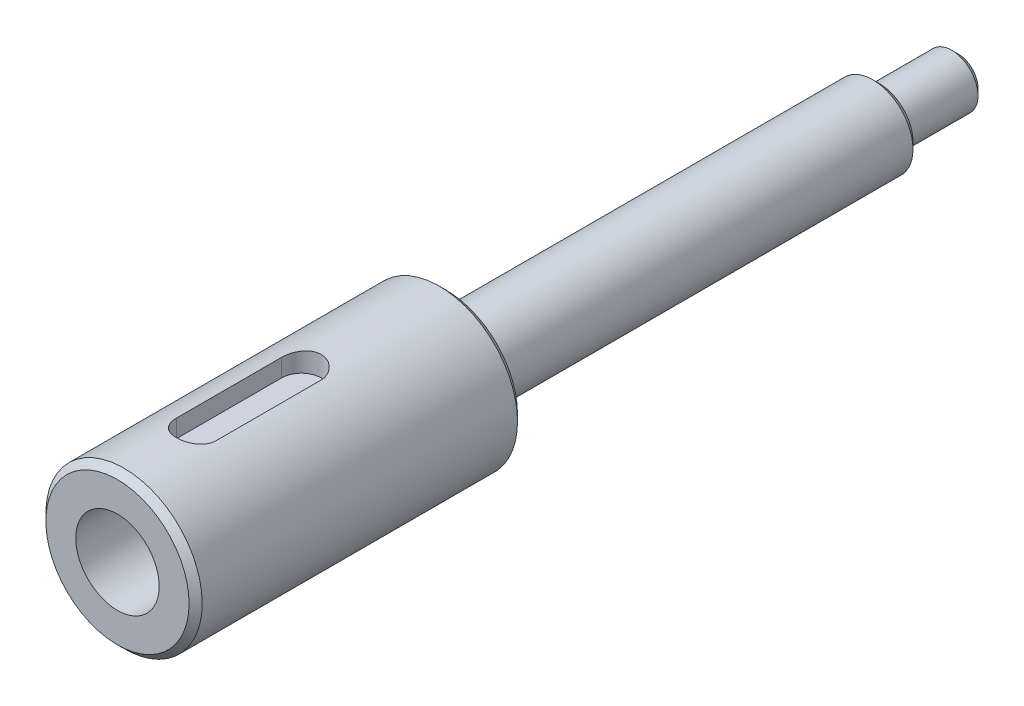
ISO-10303-21;
HEADER;
FILE_DESCRIPTION(('STEP AP214'),'2;1');
FILE_NAME('part.step','',(''),(''),'','','');
FILE_SCHEMA(('AUTOMOTIVE_DESIGN { 1 0 10303 214 1 1 1 1 }'));
ENDSEC;
DATA;
#1=APPLICATION_CONTEXT('core data for automotive mechanical design processes');
#2=APPLICATION_PROTOCOL_DEFINITION('international standard','automotive_design',2000,#1);
#3=PRODUCT_CONTEXT('',#1,'mechanical');
#4=PRODUCT('Part','Part','',(#3));
#5=PRODUCT_RELATED_PRODUCT_CATEGORY('part','',(#4));
#6=PRODUCT_DEFINITION_FORMATION('','',#4);
#7=PRODUCT_DEFINITION_CONTEXT('part definition',#1,'design');
#8=PRODUCT_DEFINITION('design','',#6,#7);
#9=PRODUCT_DEFINITION_SHAPE('','',#8);
#10=(LENGTH_UNIT() NAMED_UNIT(*) SI_UNIT(.MILLI.,.METRE.));
#11=(NAMED_UNIT(*) PLANE_ANGLE_UNIT() SI_UNIT($,.RADIAN.));
#12=(NAMED_UNIT(*) SI_UNIT($,.STERADIAN.) SOLID_ANGLE_UNIT());
#13=UNCERTAINTY_MEASURE_WITH_UNIT(LENGTH_MEASURE(1.E-05),#10,'distance_accuracy_value','');
#14=(GEOMETRIC_REPRESENTATION_CONTEXT(3) GLOBAL_UNCERTAINTY_ASSIGNED_CONTEXT((#13)) GLOBAL_UNIT_ASSIGNED_CONTEXT((#10,
#11,#12)) REPRESENTATION_CONTEXT('',''));
#15=CARTESIAN_POINT('',(0.,0.,0.));
#16=DIRECTION('',(0.,0.,1.));
#17=DIRECTION('',(1.,0.,0.));
#18=AXIS2_PLACEMENT_3D('',#15,#16,#17);
#19=CARTESIAN_POINT('',(0.,0.,-39.));
#20=DIRECTION('',(0.,0.,1.));
#21=DIRECTION('',(1.,0.,0.));
#22=AXIS2_PLACEMENT_3D('',#19,#20,#21);
#23=CYLINDRICAL_SURFACE('',#22,3.05);
#24=CARTESIAN_POINT('',(0.,0.,-32.5));
#25=DIRECTION('',(0.,0.,-1.));
#26=DIRECTION('',(-1.,0.,0.));
#27=AXIS2_PLACEMENT_3D('',#24,#25,#26);
#28=CIRCLE('',#27,3.05);
#29=CARTESIAN_POINT('',(-3.05,0.,-32.5));
#30=VERTEX_POINT('',#29);
#31=EDGE_CURVE('E12',#30,#30,#28,.F.);
#32=ORIENTED_EDGE('',*,*,#31,.T.);
#33=EDGE_LOOP('',(#32));
#34=FACE_BOUND('',#33,.T.);
#35=CARTESIAN_POINT('',(0.,0.,0.));
#36=DIRECTION('',(0.,0.,1.));
#37=DIRECTION('',(1.,0.,0.));
#38=AXIS2_PLACEMENT_3D('',#35,#36,#37);
#39=CIRCLE('',#38,3.05);
#40=CARTESIAN_POINT('',(3.05,0.,0.));
#41=VERTEX_POINT('',#40);
#42=EDGE_CURVE('E122',#41,#41,#39,.F.);
#43=ORIENTED_EDGE('',*,*,#42,.T.);
#44=EDGE_LOOP('',(#43));
#45=FACE_BOUND('',#44,.T.);
#46=ADVANCED_FACE('F39',(#34,#45),#23,.T.);
#47=CARTESIAN_POINT('',(0.,0.,25.));
#48=DIRECTION('',(0.,0.,-1.));
#49=DIRECTION('',(-1.,0.,0.));
#50=AXIS2_PLACEMENT_3D('',#47,#48,#49);
#51=CYLINDRICAL_SURFACE('',#50,5.95);
#52=CARTESIAN_POINT('',(0.,-5.95,3.5));
#53=CARTESIAN_POINT('',(0.0419493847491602,-5.94999941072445,3.49999821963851));
#54=CARTESIAN_POINT('',(0.0839249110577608,-5.94955168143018,3.49646863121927));
#55=CARTESIAN_POINT('',(0.166707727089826,-5.94780866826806,3.48244424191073));
#56=CARTESIAN_POINT('',(0.207513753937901,-5.94651250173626,3.47194218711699));
#57=CARTESIAN_POINT('',(0.286747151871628,-5.94321862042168,3.44428737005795));
#58=CARTESIAN_POINT('',(0.32517611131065,-5.94122138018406,3.42713910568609));
#59=CARTESIAN_POINT('',(0.398603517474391,-5.93674742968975,3.38668852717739));
#60=CARTESIAN_POINT('',(0.433602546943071,-5.93427080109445,3.36338726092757));
#61=CARTESIAN_POINT('',(0.499379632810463,-5.92909905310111,3.3111527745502));
#62=CARTESIAN_POINT('',(0.530135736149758,-5.92640290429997,3.28219200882));
#63=CARTESIAN_POINT('',(0.586364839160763,-5.92110427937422,3.21951975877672));
#64=CARTESIAN_POINT('',(0.611837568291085,-5.91850180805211,3.18580803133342));
#65=CARTESIAN_POINT('',(0.65685875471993,-5.91367506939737,3.11444796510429));
#66=CARTESIAN_POINT('',(0.676386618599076,-5.91145212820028,3.07678653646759));
#67=CARTESIAN_POINT('',(0.708832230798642,-5.90764973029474,2.99868608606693));
#68=CARTESIAN_POINT('',(0.721750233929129,-5.9060702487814,2.9582471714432));
#69=CARTESIAN_POINT('',(0.740542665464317,-5.90374344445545,2.87596762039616));
#70=CARTESIAN_POINT('',(0.746454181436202,-5.90299174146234,2.83413558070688));
#71=CARTESIAN_POINT('',(0.75118059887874,-5.90239220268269,2.75006694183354));
#72=CARTESIAN_POINT('',(0.749995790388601,-5.90254432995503,2.70783035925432));
#73=CARTESIAN_POINT('',(0.740593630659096,-5.90373125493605,2.62441018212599));
#74=CARTESIAN_POINT('',(0.732417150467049,-5.90476092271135,2.58322189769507));
#75=CARTESIAN_POINT('',(0.709327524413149,-5.90757890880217,2.50280673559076));
#76=CARTESIAN_POINT('',(0.694414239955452,-5.90936724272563,2.46357989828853));
#77=CARTESIAN_POINT('',(0.658230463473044,-5.9135068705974,2.38807426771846));
#78=CARTESIAN_POINT('',(0.636942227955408,-5.91585973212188,2.35180406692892));
#79=CARTESIAN_POINT('',(0.588625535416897,-5.92086209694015,2.28333544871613));
#80=CARTESIAN_POINT('',(0.561596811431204,-5.92351161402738,2.25113722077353));
#81=CARTESIAN_POINT('',(0.502339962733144,-5.928831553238,2.19148932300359));
#82=CARTESIAN_POINT('',(0.470076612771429,-5.9315019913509,2.16407463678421));
#83=CARTESIAN_POINT('',(0.401387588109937,-5.93654545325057,2.1150444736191));
#84=CARTESIAN_POINT('',(0.364961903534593,-5.93891847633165,2.09342901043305));
#85=CARTESIAN_POINT('',(0.288955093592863,-5.94310124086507,2.05661078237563));
#86=CARTESIAN_POINT('',(0.249372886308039,-5.94491078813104,2.04141022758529));
#87=CARTESIAN_POINT('',(0.168189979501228,-5.94776095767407,2.01788117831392));
#88=CARTESIAN_POINT('',(0.126589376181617,-5.94880161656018,2.00955235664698));
#89=CARTESIAN_POINT('',(0.0428530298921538,-5.94999199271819,2.00004858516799));
#90=CARTESIAN_POINT('',(0.000722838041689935,-5.95014771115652,1.9988254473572));
#91=CARTESIAN_POINT('',(-0.0831419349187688,-5.94956686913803,2.00344056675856));
#92=CARTESIAN_POINT('',(-0.124876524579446,-5.94883032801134,2.00927867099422));
#93=CARTESIAN_POINT('',(-0.206623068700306,-5.94655146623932,2.02781051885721));
#94=CARTESIAN_POINT('',(-0.246640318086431,-5.94501184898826,2.04048126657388));
#95=CARTESIAN_POINT('',(-0.323981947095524,-5.94129919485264,2.07229480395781));
#96=CARTESIAN_POINT('',(-0.361306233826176,-5.93912613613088,2.09143781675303));
#97=CARTESIAN_POINT('',(-0.432417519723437,-5.93437388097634,2.13576893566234));
#98=CARTESIAN_POINT('',(-0.466184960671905,-5.9317926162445,2.16098818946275));
#99=CARTESIAN_POINT('',(-0.529024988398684,-5.92651911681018,2.21671186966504));
#100=CARTESIAN_POINT('',(-0.558097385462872,-5.92382687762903,2.247216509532));
#101=CARTESIAN_POINT('',(-0.610893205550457,-5.91861632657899,2.31285739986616));
#102=CARTESIAN_POINT('',(-0.63458467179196,-5.91609911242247,2.34801945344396));
#103=CARTESIAN_POINT('',(-0.675725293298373,-5.9115417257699,2.42185193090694));
#104=CARTESIAN_POINT('',(-0.693174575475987,-5.90950154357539,2.46052228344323));
#105=CARTESIAN_POINT('',(-0.721283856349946,-5.90613670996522,2.54017083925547));
#106=CARTESIAN_POINT('',(-0.731961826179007,-5.90481016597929,2.58114261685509));
#107=CARTESIAN_POINT('',(-0.746283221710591,-5.90301738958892,2.66431548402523));
#108=CARTESIAN_POINT('',(-0.749926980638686,-5.90255111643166,2.70651651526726));
#109=CARTESIAN_POINT('',(-0.750070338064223,-5.90253287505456,2.79063200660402));
#110=CARTESIAN_POINT('',(-0.746620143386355,-5.90297448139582,2.83254638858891));
#111=CARTESIAN_POINT('',(-0.732779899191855,-5.90470842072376,2.91519443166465));
#112=CARTESIAN_POINT('',(-0.722389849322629,-5.90600075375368,2.9559280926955));
#113=CARTESIAN_POINT('',(-0.694980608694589,-5.90928853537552,3.03505152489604));
#114=CARTESIAN_POINT('',(-0.677963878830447,-5.91128372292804,3.07344216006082));
#115=CARTESIAN_POINT('',(-0.637789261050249,-5.91575283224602,3.14683117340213));
#116=CARTESIAN_POINT('',(-0.614631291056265,-5.91822676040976,3.18182950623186));
#117=CARTESIAN_POINT('',(-0.562645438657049,-5.92339557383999,3.24769703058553));
#118=CARTESIAN_POINT('',(-0.533780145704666,-5.92609184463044,3.27853658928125));
#119=CARTESIAN_POINT('',(-0.471277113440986,-5.93138933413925,3.33495337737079));
#120=CARTESIAN_POINT('',(-0.437638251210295,-5.93399053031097,3.36052936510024));
#121=CARTESIAN_POINT('',(-0.366393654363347,-5.93881590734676,3.40577736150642));
#122=CARTESIAN_POINT('',(-0.328773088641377,-5.94103859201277,3.42542616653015));
#123=CARTESIAN_POINT('',(-0.250759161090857,-5.9448413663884,3.45809917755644));
#124=CARTESIAN_POINT('',(-0.21036886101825,-5.94642215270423,3.47113056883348));
#125=CARTESIAN_POINT('',(-0.141475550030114,-5.94838273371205,3.48708581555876));
#126=CARTESIAN_POINT('',(-0.113406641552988,-5.94898624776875,3.4919216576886));
#127=CARTESIAN_POINT('',(-0.0568958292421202,-5.94979507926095,3.49837934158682));
#128=CARTESIAN_POINT('',(-0.0284539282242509,-5.95000039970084,3.50000120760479));
#129=CARTESIAN_POINT('',(0.,-5.95,3.5));
#130=B_SPLINE_CURVE_WITH_KNOTS('',3,(#52,#53,#54,#55,#56,#57,#58,#59,#60,#61,#62,#63,#64,#65,
#66,#67,#68,#69,#70,#71,#72,#73,#74,#75,#76,#77,#78,#79,#80,#81,#82,#83,#84,#85,#86,#87,#88,#89,
#90,#91,#92,#93,#94,#95,#96,#97,#98,#99,#100,#101,#102,#103,#104,#105,#106,#107,#108,#109,#110,
#111,#112,#113,#114,#115,#116,#117,#118,#119,#120,#121,#122,#123,#124,#125,#126,#127,#128,#129),
.UNSPECIFIED.,.T.,.F.,(4,2,2,2,2,2,2,2,2,2,2,2,2,2,2,2,2,2,2,2,2,2,2,2,2,2,2,2,2,2,2,2,2,2,2,2,
2,2,4),(0.,0.125744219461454,0.251619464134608,0.377409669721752,0.503178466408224,
0.629575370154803,0.755978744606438,0.882815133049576,1.00964663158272,1.13580372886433,
1.26195566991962,1.38737516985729,1.51279725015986,1.63857171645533,1.76435203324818,
1.89101682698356,2.01768192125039,2.14439061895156,2.27109328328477,2.39693568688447,
2.52277536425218,2.64819413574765,2.77361723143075,2.89969748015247,3.02578282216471,
3.15259845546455,3.27941151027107,3.40588657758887,3.53235565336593,3.65793273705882,
3.78350982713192,3.90904032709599,4.03457250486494,4.16095656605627,4.28737040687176,
4.41427289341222,4.54103729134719,4.62632922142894,4.71162050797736),.UNSPECIFIED.);
#131=CARTESIAN_POINT('',(0.,-5.95,3.5));
#132=VERTEX_POINT('',#131);
#133=EDGE_CURVE('E104',#132,#132,#130,.T.);
#134=ORIENTED_EDGE('',*,*,#133,.T.);
#135=EDGE_LOOP('',(#134));
#136=FACE_BOUND('',#135,.T.);
#137=DIRECTION('',(0.,0.,-1.));
#138=VECTOR('',#137,1.);
#139=CARTESIAN_POINT('',(1.5,5.75782076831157,25.));
#140=LINE('',#139,#138);
#141=CARTESIAN_POINT('',(1.5,5.75782076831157,11.));
#142=VERTEX_POINT('',#141);
#143=CARTESIAN_POINT('',(1.5,5.75782076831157,19.));
#144=VERTEX_POINT('',#143);
#145=EDGE_CURVE('E144',#142,#144,#140,.F.);
#146=ORIENTED_EDGE('',*,*,#145,.T.);
#147=CARTESIAN_POINT('',(1.5,5.75782076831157,19.));
#148=CARTESIAN_POINT('',(1.50000051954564,5.75781794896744,19.0414824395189));
#149=CARTESIAN_POINT('',(1.49827811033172,5.75826963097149,19.0829443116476));
#150=CARTESIAN_POINT('',(1.49141196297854,5.76005287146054,19.1655577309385));
#151=CARTESIAN_POINT('',(1.48626880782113,5.76138428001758,19.2067093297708));
#152=CARTESIAN_POINT('',(1.46578353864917,5.76664453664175,19.3290808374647));
#153=CARTESIAN_POINT('',(1.44538528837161,5.77183974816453,19.4094594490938));
#154=CARTESIAN_POINT('',(1.39176749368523,5.78500082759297,19.5655093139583));
#155=CARTESIAN_POINT('',(1.35854927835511,5.79296640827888,19.6411810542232));
#156=CARTESIAN_POINT('',(1.28027492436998,5.81076604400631,19.7859162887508));
#157=CARTESIAN_POINT('',(1.2352155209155,5.8206006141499,19.8549779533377));
#158=CARTESIAN_POINT('',(1.13347307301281,5.8412738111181,19.986031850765));
#159=CARTESIAN_POINT('',(1.0765752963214,5.85212860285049,20.0478547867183));
#160=CARTESIAN_POINT('',(0.9532283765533,5.87347999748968,20.1611941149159));
#161=CARTESIAN_POINT('',(0.886777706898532,5.88397654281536,20.2127088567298));
#162=CARTESIAN_POINT('',(0.745045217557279,5.90360822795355,20.3046618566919));
#163=CARTESIAN_POINT('',(0.669651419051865,5.91272192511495,20.3449324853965));
#164=CARTESIAN_POINT('',(0.512900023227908,5.9283748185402,20.4121623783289));
#165=CARTESIAN_POINT('',(0.43154361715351,5.93491452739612,20.4391242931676));
#166=CARTESIAN_POINT('',(0.266949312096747,5.94456823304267,20.4784278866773));
#167=CARTESIAN_POINT('',(0.183784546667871,5.94774993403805,20.4910589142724));
#168=CARTESIAN_POINT('',(0.0164577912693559,5.95056519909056,20.5022507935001));
#169=CARTESIAN_POINT('',(-0.0677040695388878,5.95019921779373,20.5008134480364));
#170=CARTESIAN_POINT('',(-0.232624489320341,5.9460105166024,20.4841164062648));
#171=CARTESIAN_POINT('',(-0.313416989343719,5.94226599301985,20.4691693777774));
#172=CARTESIAN_POINT('',(-0.471307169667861,5.93183220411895,20.4263803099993));
#173=CARTESIAN_POINT('',(-0.548404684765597,5.92514280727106,20.3985376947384));
#174=CARTESIAN_POINT('',(-0.69753873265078,5.9094516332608,20.3304961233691));
#175=CARTESIAN_POINT('',(-0.769522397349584,5.90042922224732,20.2901862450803));
#176=CARTESIAN_POINT('',(-0.905811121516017,5.8810502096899,20.1984393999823));
#177=CARTESIAN_POINT('',(-0.970114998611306,5.87069340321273,20.1470007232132));
#178=CARTESIAN_POINT('',(-1.09107879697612,5.84943813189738,20.0327894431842));
#179=CARTESIAN_POINT('',(-1.14748090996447,5.83853260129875,19.9697448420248));
#180=CARTESIAN_POINT('',(-1.24898346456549,5.81766568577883,19.8349597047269));
#181=CARTESIAN_POINT('',(-1.29408080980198,5.80770455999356,19.763216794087));
#182=CARTESIAN_POINT('',(-1.37186606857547,5.78982652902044,19.6125475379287));
#183=CARTESIAN_POINT('',(-1.40448392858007,5.78192124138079,19.5335836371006));
#184=CARTESIAN_POINT('',(-1.45585909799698,5.76920154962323,19.371091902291));
#185=CARTESIAN_POINT('',(-1.47463713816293,5.7643825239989,19.2875710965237));
#186=CARTESIAN_POINT('',(-1.49078909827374,5.76021381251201,19.1694372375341));
#187=CARTESIAN_POINT('',(-1.49424374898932,5.7593178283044,19.1356202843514));
#188=CARTESIAN_POINT('',(-1.4988466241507,5.75812155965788,19.0678742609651));
#189=CARTESIAN_POINT('',(-1.49999857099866,5.75782031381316,19.033945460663));
#190=CARTESIAN_POINT('',(-1.5,5.75782076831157,19.));
#191=B_SPLINE_CURVE_WITH_KNOTS('',3,(#147,#148,#149,#150,#151,#152,#153,#154,#155,#156,#157,
#158,#159,#160,#161,#162,#163,#164,#165,#166,#167,#168,#169,#170,#171,#172,#173,#174,#175,#176,
#177,#178,#179,#180,#181,#182,#183,#184,#185,#186,#187,#188,#189,#190),.UNSPECIFIED.,.F.,.F.,(4,
2,2,2,2,2,2,2,2,2,2,2,2,2,2,2,2,2,2,2,2,4),(0.,0.12436866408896,0.248716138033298,
0.496694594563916,0.744647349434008,0.992668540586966,1.24565730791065,1.49868654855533,
1.75530791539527,2.01187815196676,2.26317037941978,2.51443040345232,2.76002011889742,
3.0056208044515,3.25347273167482,3.50136276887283,3.7560469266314,4.01080076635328,
4.26696438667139,4.52274351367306,4.6246908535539,4.72647325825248),.UNSPECIFIED.);
#192=CARTESIAN_POINT('',(-1.5,5.75782076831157,19.));
#193=VERTEX_POINT('',#192);
#194=EDGE_CURVE('E182',#144,#193,#191,.T.);
#195=ORIENTED_EDGE('',*,*,#194,.T.);
#196=DIRECTION('',(0.,0.,-1.));
#197=VECTOR('',#196,1.);
#198=CARTESIAN_POINT('',(-1.5,5.75782076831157,25.));
#199=LINE('',#198,#197);
#200=CARTESIAN_POINT('',(-1.5,5.75782076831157,11.));
#201=VERTEX_POINT('',#200);
#202=EDGE_CURVE('E156',#193,#201,#199,.T.);
#203=ORIENTED_EDGE('',*,*,#202,.T.);
#204=CARTESIAN_POINT('',(-1.5,5.75782076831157,11.));
#205=CARTESIAN_POINT('',(-1.50000051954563,5.75781794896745,10.9585175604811));
#206=CARTESIAN_POINT('',(-1.49827811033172,5.75826963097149,10.9170556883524));
#207=CARTESIAN_POINT('',(-1.49141196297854,5.76005287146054,10.8344422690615));
#208=CARTESIAN_POINT('',(-1.48626880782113,5.76138428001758,10.7932906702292));
#209=CARTESIAN_POINT('',(-1.46578353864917,5.76664453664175,10.6709191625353));
#210=CARTESIAN_POINT('',(-1.44538528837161,5.77183974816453,10.5905405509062));
#211=CARTESIAN_POINT('',(-1.39176749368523,5.78500082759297,10.4344906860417));
#212=CARTESIAN_POINT('',(-1.35854927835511,5.79296640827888,10.3588189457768));
#213=CARTESIAN_POINT('',(-1.28027492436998,5.81076604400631,10.2140837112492));
#214=CARTESIAN_POINT('',(-1.2352155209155,5.8206006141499,10.1450220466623));
#215=CARTESIAN_POINT('',(-1.13347307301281,5.84127381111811,10.013968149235));
#216=CARTESIAN_POINT('',(-1.0765752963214,5.85212860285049,9.95214521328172));
#217=CARTESIAN_POINT('',(-0.953228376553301,5.87347999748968,9.83880588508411));
#218=CARTESIAN_POINT('',(-0.886777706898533,5.88397654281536,9.78729114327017));
#219=CARTESIAN_POINT('',(-0.74504521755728,5.90360822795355,9.6953381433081));
#220=CARTESIAN_POINT('',(-0.669651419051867,5.91272192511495,9.65506751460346));
#221=CARTESIAN_POINT('',(-0.512900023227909,5.9283748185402,9.58783762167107));
#222=CARTESIAN_POINT('',(-0.431543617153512,5.93491452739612,9.56087570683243));
#223=CARTESIAN_POINT('',(-0.266949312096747,5.94456823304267,9.52157211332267));
#224=CARTESIAN_POINT('',(-0.183784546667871,5.94774993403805,9.50894108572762));
#225=CARTESIAN_POINT('',(-0.0164577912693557,5.95056519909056,9.49774920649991));
#226=CARTESIAN_POINT('',(0.067704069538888,5.95019921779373,9.49918655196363));
#227=CARTESIAN_POINT('',(0.232624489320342,5.9460105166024,9.51588359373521));
#228=CARTESIAN_POINT('',(0.31341698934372,5.94226599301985,9.53083062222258));
#229=CARTESIAN_POINT('',(0.471307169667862,5.93183220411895,9.57361969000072));
#230=CARTESIAN_POINT('',(0.548404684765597,5.92514280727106,9.60146230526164));
#231=CARTESIAN_POINT('',(0.69753873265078,5.9094516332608,9.66950387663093));
#232=CARTESIAN_POINT('',(0.769522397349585,5.90042922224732,9.70981375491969));
#233=CARTESIAN_POINT('',(0.905811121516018,5.8810502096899,9.80156060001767));
#234=CARTESIAN_POINT('',(0.970114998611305,5.87069340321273,9.85299927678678));
#235=CARTESIAN_POINT('',(1.09107879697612,5.84943813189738,9.96721055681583));
#236=CARTESIAN_POINT('',(1.14748090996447,5.83853260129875,10.0302551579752));
#237=CARTESIAN_POINT('',(1.24898346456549,5.81766568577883,10.1650402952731));
#238=CARTESIAN_POINT('',(1.29408080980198,5.80770455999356,10.2367832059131));
#239=CARTESIAN_POINT('',(1.37186606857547,5.78982652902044,10.3874524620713));
#240=CARTESIAN_POINT('',(1.40448392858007,5.78192124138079,10.4664163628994));
#241=CARTESIAN_POINT('',(1.45585909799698,5.76920154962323,10.6289080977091));
#242=CARTESIAN_POINT('',(1.47463713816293,5.7643825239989,10.7124289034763));
#243=CARTESIAN_POINT('',(1.49078909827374,5.76021381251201,10.830562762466));
#244=CARTESIAN_POINT('',(1.49424374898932,5.7593178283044,10.8643797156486));
#245=CARTESIAN_POINT('',(1.4988466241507,5.75812155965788,10.9321257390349));
#246=CARTESIAN_POINT('',(1.49999857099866,5.75782031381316,10.966054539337));
#247=CARTESIAN_POINT('',(1.5,5.75782076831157,11.));
#248=B_SPLINE_CURVE_WITH_KNOTS('',3,(#204,#205,#206,#207,#208,#209,#210,#211,#212,#213,#214,
#215,#216,#217,#218,#219,#220,#221,#222,#223,#224,#225,#226,#227,#228,#229,#230,#231,#232,#233,
#234,#235,#236,#237,#238,#239,#240,#241,#242,#243,#244,#245,#246,#247),.UNSPECIFIED.,.F.,.F.,(4,
2,2,2,2,2,2,2,2,2,2,2,2,2,2,2,2,2,2,2,2,4),(0.,0.124368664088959,0.2487161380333,
0.496694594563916,0.74464734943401,0.992668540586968,1.24565730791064,1.49868654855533,
1.75530791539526,2.01187815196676,2.26317037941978,2.51443040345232,2.76002011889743,
3.00562080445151,3.25347273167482,3.50136276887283,3.7560469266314,4.01080076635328,
4.26696438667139,4.52274351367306,4.62469085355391,4.72647325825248),.UNSPECIFIED.);
#249=EDGE_CURVE('E147',#201,#142,#248,.T.);
#250=ORIENTED_EDGE('',*,*,#249,.T.);
#251=EDGE_LOOP('',(#146,#195,#203,#250));
#252=FACE_BOUND('',#251,.T.);
#253=CARTESIAN_POINT('',(0.,0.,24.5));
#254=DIRECTION('',(0.,0.,1.));
#255=DIRECTION('',(1.,0.,0.));
#256=AXIS2_PLACEMENT_3D('',#253,#254,#255);
#257=CIRCLE('',#256,5.95);
#258=CARTESIAN_POINT('',(5.95,0.,24.5));
#259=VERTEX_POINT('',#258);
#260=EDGE_CURVE('E138',#259,#259,#257,.F.);
#261=ORIENTED_EDGE('',*,*,#260,.T.);
#262=EDGE_LOOP('',(#261));
#263=FACE_BOUND('',#262,.T.);
#264=CARTESIAN_POINT('',(0.,0.,0.5));
#265=DIRECTION('',(0.,0.,1.));
#266=DIRECTION('',(1.,0.,0.));
#267=AXIS2_PLACEMENT_3D('',#264,#265,#266);
#268=CIRCLE('',#267,5.95);
#269=CARTESIAN_POINT('',(5.95,0.,0.5));
#270=VERTEX_POINT('',#269);
#271=EDGE_CURVE('E135',#270,#270,#268,.T.);
#272=ORIENTED_EDGE('',*,*,#271,.T.);
#273=EDGE_LOOP('',(#272));
#274=FACE_BOUND('',#273,.T.);
#275=ADVANCED_FACE('F158',(#136,#252,#263,#274),#51,.T.);
#276=CARTESIAN_POINT('',(0.,0.,25.));
#277=DIRECTION('',(0.,0.,1.));
#278=DIRECTION('',(1.,0.,0.));
#279=AXIS2_PLACEMENT_3D('',#276,#277,#278);
#280=PLANE('',#279);
#281=CARTESIAN_POINT('',(0.,0.,25.));
#282=DIRECTION('',(0.,0.,1.));
#283=DIRECTION('',(1.,0.,0.));
#284=AXIS2_PLACEMENT_3D('',#281,#282,#283);
#285=CIRCLE('',#284,3.175);
#286=CARTESIAN_POINT('',(3.175,0.,25.));
#287=VERTEX_POINT('',#286);
#288=EDGE_CURVE('E97',#287,#287,#285,.T.);
#289=ORIENTED_EDGE('',*,*,#288,.F.);
#290=EDGE_LOOP('',(#289));
#291=FACE_BOUND('',#290,.T.);
#292=CARTESIAN_POINT('',(0.,0.,25.));
#293=DIRECTION('',(0.,0.,1.));
#294=DIRECTION('',(1.,0.,0.));
#295=AXIS2_PLACEMENT_3D('',#292,#293,#294);
#296=CIRCLE('',#295,5.45);
#297=CARTESIAN_POINT('',(5.45,0.,25.));
#298=VERTEX_POINT('',#297);
#299=EDGE_CURVE('E132',#298,#298,#296,.T.);
#300=ORIENTED_EDGE('',*,*,#299,.T.);
#301=EDGE_LOOP('',(#300));
#302=FACE_BOUND('',#301,.T.);
#303=ADVANCED_FACE('F215',(#291,#302),#280,.T.);
#304=CARTESIAN_POINT('',(0.,0.,0.));
#305=DIRECTION('',(0.,0.,1.));
#306=DIRECTION('',(1.,0.,0.));
#307=AXIS2_PLACEMENT_3D('',#304,#305,#306);
#308=PLANE('',#307);
#309=CARTESIAN_POINT('',(0.,0.,0.));
#310=DIRECTION('',(0.,0.,1.));
#311=DIRECTION('',(1.,0.,0.));
#312=AXIS2_PLACEMENT_3D('',#309,#310,#311);
#313=CIRCLE('',#312,5.45);
#314=CARTESIAN_POINT('',(5.45,0.,0.));
#315=VERTEX_POINT('',#314);
#316=EDGE_CURVE('E141',#315,#315,#313,.F.);
#317=ORIENTED_EDGE('',*,*,#316,.T.);
#318=EDGE_LOOP('',(#317));
#319=FACE_BOUND('',#318,.T.);
#320=ORIENTED_EDGE('',*,*,#42,.F.);
#321=EDGE_LOOP('',(#320));
#322=FACE_BOUND('',#321,.T.);
#323=ADVANCED_FACE('F220',(#319,#322),#308,.F.);
#324=CARTESIAN_POINT('',(0.,0.,25.));
#325=DIRECTION('',(0.,0.,-1.));
#326=DIRECTION('',(-1.,0.,0.));
#327=AXIS2_PLACEMENT_3D('',#324,#325,#326);
#328=CONICAL_SURFACE('',#327,5.45,0.785398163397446);
#329=ORIENTED_EDGE('',*,*,#260,.F.);
#330=EDGE_LOOP('',(#329));
#331=FACE_BOUND('',#330,.T.);
#332=ORIENTED_EDGE('',*,*,#299,.F.);
#333=EDGE_LOOP('',(#332));
#334=FACE_BOUND('',#333,.T.);
#335=ADVANCED_FACE('F223',(#331,#334),#328,.T.);
#336=CARTESIAN_POINT('',(0.,0.,0.5));
#337=DIRECTION('',(0.,0.,1.));
#338=DIRECTION('',(1.,0.,0.));
#339=AXIS2_PLACEMENT_3D('',#336,#337,#338);
#340=CONICAL_SURFACE('',#339,5.95,0.785398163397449);
#341=ORIENTED_EDGE('',*,*,#316,.F.);
#342=EDGE_LOOP('',(#341));
#343=FACE_BOUND('',#342,.T.);
#344=ORIENTED_EDGE('',*,*,#271,.F.);
#345=EDGE_LOOP('',(#344));
#346=FACE_BOUND('',#345,.T.);
#347=ADVANCED_FACE('F178',(#343,#346),#340,.T.);
#348=CARTESIAN_POINT('',(0.,4.4,19.));
#349=DIRECTION('',(0.,1.,0.));
#350=DIRECTION('',(0.,0.,1.));
#351=AXIS2_PLACEMENT_3D('',#348,#349,#350);
#352=CYLINDRICAL_SURFACE('',#351,1.5);
#353=DIRECTION('',(0.,1.,0.));
#354=VECTOR('',#353,1.);
#355=CARTESIAN_POINT('',(1.5,4.4,19.));
#356=LINE('',#355,#354);
#357=CARTESIAN_POINT('',(1.5,4.4,19.));
#358=VERTEX_POINT('',#357);
#359=EDGE_CURVE('E64',#358,#144,#356,.T.);
#360=ORIENTED_EDGE('',*,*,#359,.F.);
#361=CARTESIAN_POINT('',(0.,4.4,19.));
#362=DIRECTION('',(0.,1.,0.));
#363=DIRECTION('',(0.,0.,1.));
#364=AXIS2_PLACEMENT_3D('',#361,#362,#363);
#365=CIRCLE('',#364,1.5);
#366=CARTESIAN_POINT('',(-1.5,4.4,19.));
#367=VERTEX_POINT('',#366);
#368=EDGE_CURVE('E101',#367,#358,#365,.T.);
#369=ORIENTED_EDGE('',*,*,#368,.F.);
#370=DIRECTION('',(0.,1.,0.));
#371=VECTOR('',#370,1.);
#372=CARTESIAN_POINT('',(-1.5,4.4,19.));
#373=LINE('',#372,#371);
#374=EDGE_CURVE('E119',#367,#193,#373,.T.);
#375=ORIENTED_EDGE('',*,*,#374,.T.);
#376=ORIENTED_EDGE('',*,*,#194,.F.);
#377=EDGE_LOOP('',(#360,#369,#375,#376));
#378=FACE_BOUND('',#377,.T.);
#379=ADVANCED_FACE('F174',(#378),#352,.F.);
#380=CARTESIAN_POINT('',(-1.5,4.4,19.));
#381=DIRECTION('',(-1.,0.,0.));
#382=DIRECTION('',(0.,0.,1.));
#383=AXIS2_PLACEMENT_3D('',#380,#381,#382);
#384=PLANE('',#383);
#385=ORIENTED_EDGE('',*,*,#374,.F.);
#386=DIRECTION('',(0.,0.,1.));
#387=VECTOR('',#386,1.);
#388=CARTESIAN_POINT('',(-1.5,4.4,19.));
#389=LINE('',#388,#387);
#390=CARTESIAN_POINT('',(-1.5,4.4,11.));
#391=VERTEX_POINT('',#390);
#392=EDGE_CURVE('E116',#391,#367,#389,.T.);
#393=ORIENTED_EDGE('',*,*,#392,.F.);
#394=DIRECTION('',(0.,1.,0.));
#395=VECTOR('',#394,1.);
#396=CARTESIAN_POINT('',(-1.5,4.4,11.));
#397=LINE('',#396,#395);
#398=EDGE_CURVE('E123',#391,#201,#397,.T.);
#399=ORIENTED_EDGE('',*,*,#398,.T.);
#400=ORIENTED_EDGE('',*,*,#202,.F.);
#401=EDGE_LOOP('',(#385,#393,#399,#400));
#402=FACE_BOUND('',#401,.T.);
#403=ADVANCED_FACE('F168',(#402),#384,.F.);
#404=CARTESIAN_POINT('',(0.,4.4,11.));
#405=DIRECTION('',(0.,1.,0.));
#406=DIRECTION('',(0.,0.,1.));
#407=AXIS2_PLACEMENT_3D('',#404,#405,#406);
#408=CYLINDRICAL_SURFACE('',#407,1.5);
#409=ORIENTED_EDGE('',*,*,#398,.F.);
#410=CARTESIAN_POINT('',(0.,4.4,11.));
#411=DIRECTION('',(0.,1.,0.));
#412=DIRECTION('',(0.,0.,1.));
#413=AXIS2_PLACEMENT_3D('',#410,#411,#412);
#414=CIRCLE('',#413,1.5);
#415=CARTESIAN_POINT('',(1.5,4.4,11.));
#416=VERTEX_POINT('',#415);
#417=EDGE_CURVE('E113',#416,#391,#414,.T.);
#418=ORIENTED_EDGE('',*,*,#417,.F.);
#419=DIRECTION('',(0.,1.,0.));
#420=VECTOR('',#419,1.);
#421=CARTESIAN_POINT('',(1.5,4.4,11.));
#422=LINE('',#421,#420);
#423=EDGE_CURVE('E126',#416,#142,#422,.T.);
#424=ORIENTED_EDGE('',*,*,#423,.T.);
#425=ORIENTED_EDGE('',*,*,#249,.F.);
#426=EDGE_LOOP('',(#409,#418,#424,#425));
#427=FACE_BOUND('',#426,.T.);
#428=ADVANCED_FACE('F162',(#427),#408,.F.);
#429=CARTESIAN_POINT('',(1.5,4.4,19.));
#430=DIRECTION('',(1.,0.,0.));
#431=DIRECTION('',(0.,0.,-1.));
#432=AXIS2_PLACEMENT_3D('',#429,#430,#431);
#433=PLANE('',#432);
#434=ORIENTED_EDGE('',*,*,#423,.F.);
#435=DIRECTION('',(0.,0.,-1.));
#436=VECTOR('',#435,1.);
#437=CARTESIAN_POINT('',(1.5,4.4,19.));
#438=LINE('',#437,#436);
#439=EDGE_CURVE('E110',#358,#416,#438,.T.);
#440=ORIENTED_EDGE('',*,*,#439,.F.);
#441=ORIENTED_EDGE('',*,*,#359,.T.);
#442=ORIENTED_EDGE('',*,*,#145,.F.);
#443=EDGE_LOOP('',(#434,#440,#441,#442));
#444=FACE_BOUND('',#443,.T.);
#445=ADVANCED_FACE('F167',(#444),#433,.F.);
#446=CARTESIAN_POINT('',(0.,4.4,19.));
#447=DIRECTION('',(0.,1.,0.));
#448=DIRECTION('',(0.,0.,1.));
#449=AXIS2_PLACEMENT_3D('',#446,#447,#448);
#450=PLANE('',#449);
#451=ORIENTED_EDGE('',*,*,#368,.T.);
#452=ORIENTED_EDGE('',*,*,#439,.T.);
#453=ORIENTED_EDGE('',*,*,#417,.T.);
#454=ORIENTED_EDGE('',*,*,#392,.T.);
#455=EDGE_LOOP('',(#451,#452,#453,#454));
#456=FACE_BOUND('',#455,.T.);
#457=ADVANCED_FACE('F173',(#456),#450,.T.);
#458=CARTESIAN_POINT('',(0.,0.,25.));
#459=DIRECTION('',(0.,0.,1.));
#460=DIRECTION('',(1.,0.,0.));
#461=AXIS2_PLACEMENT_3D('',#458,#459,#460);
#462=CYLINDRICAL_SURFACE('',#461,3.175);
#463=CARTESIAN_POINT('',(0.,0.,3.5));
#464=DIRECTION('',(0.,0.,1.));
#465=DIRECTION('',(1.,0.,0.));
#466=AXIS2_PLACEMENT_3D('',#463,#464,#465);
#467=CIRCLE('',#466,3.175);
#468=CARTESIAN_POINT('',(0.,-3.175,3.5));
#469=VERTEX_POINT('',#468);
#470=EDGE_CURVE('E95',#469,#469,#467,.T.);
#471=ORIENTED_EDGE('',*,*,#470,.F.);
#472=EDGE_LOOP('',(#471));
#473=FACE_BOUND('',#472,.T.);
#474=ORIENTED_EDGE('',*,*,#288,.T.);
#475=EDGE_LOOP('',(#474));
#476=FACE_BOUND('',#475,.T.);
#477=ADVANCED_FACE('F92',(#473,#476),#462,.F.);
#478=CARTESIAN_POINT('',(0.,0.,3.5));
#479=DIRECTION('',(0.,0.,1.));
#480=DIRECTION('',(1.,0.,0.));
#481=AXIS2_PLACEMENT_3D('',#478,#479,#480);
#482=CONICAL_SURFACE('',#481,3.175,1.02974425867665);
#483=CARTESIAN_POINT('',(0.,0.,1.5922675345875));
#484=VERTEX_POINT('',#483);
#485=VERTEX_LOOP('',#484);
#486=FACE_BOUND('',#485,.T.);
#487=ORIENTED_EDGE('',*,*,#470,.T.);
#488=CARTESIAN_POINT('',(-0.306342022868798,-3.05078670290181,3.4345834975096));
#489=CARTESIAN_POINT('',(-0.329385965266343,-3.03122632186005,3.42427251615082));
#490=CARTESIAN_POINT('',(-0.350941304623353,-3.01030215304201,3.41323788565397));
#491=CARTESIAN_POINT('',(-0.391459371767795,-2.96656271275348,3.39015815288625));
#492=CARTESIAN_POINT('',(-0.410417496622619,-2.94374419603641,3.37811131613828));
#493=CARTESIAN_POINT('',(-0.464136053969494,-2.87304370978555,3.34076130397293));
#494=CARTESIAN_POINT('',(-0.495490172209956,-2.82315050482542,3.31437173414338));
#495=CARTESIAN_POINT('',(-0.547716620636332,-2.72707688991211,3.2634717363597));
#496=CARTESIAN_POINT('',(-0.569412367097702,-2.68122245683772,3.23914440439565));
#497=CARTESIAN_POINT('',(-0.60844705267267,-2.58808098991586,3.18964361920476));
#498=CARTESIAN_POINT('',(-0.625781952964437,-2.54079267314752,3.16446940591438));
#499=CARTESIAN_POINT('',(-0.656669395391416,-2.44535019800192,3.11355279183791));
#500=CARTESIAN_POINT('',(-0.670223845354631,-2.39719648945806,3.08781068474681));
#501=CARTESIAN_POINT('',(-0.69396573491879,-2.30029896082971,3.03587736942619));
#502=CARTESIAN_POINT('',(-0.704152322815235,-2.25155499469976,3.00968604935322));
#503=CARTESIAN_POINT('',(-0.72624705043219,-2.12635571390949,2.94220028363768));
#504=CARTESIAN_POINT('',(-0.735934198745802,-2.04964193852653,2.90064780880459));
#505=CARTESIAN_POINT('',(-0.748218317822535,-1.89595922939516,2.81681783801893));
#506=CARTESIAN_POINT('',(-0.75080825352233,-1.81899011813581,2.7745396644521));
#507=CARTESIAN_POINT('',(-0.748755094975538,-1.66537614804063,2.68926958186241));
#508=CARTESIAN_POINT('',(-0.744100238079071,-1.58873201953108,2.64627662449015));
#509=CARTESIAN_POINT('',(-0.726786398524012,-1.43679515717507,2.55962734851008));
#510=CARTESIAN_POINT('',(-0.714139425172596,-1.36150056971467,2.51597212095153));
#511=CARTESIAN_POINT('',(-0.688232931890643,-1.25280223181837,2.45111766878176));
#512=CARTESIAN_POINT('',(-0.678826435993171,-1.21828135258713,2.4302385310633));
#513=CARTESIAN_POINT('',(-0.657432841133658,-1.15018109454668,2.38828429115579));
#514=CARTESIAN_POINT('',(-0.645447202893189,-1.11660119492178,2.36720930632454));
#515=CARTESIAN_POINT('',(-0.618467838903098,-1.05102331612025,2.32500434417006));
#516=CARTESIAN_POINT('',(-0.603493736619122,-1.01901663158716,2.30387556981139));
#517=CARTESIAN_POINT('',(-0.569786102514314,-0.957126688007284,2.26155799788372));
#518=CARTESIAN_POINT('',(-0.551059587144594,-0.927239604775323,2.24036938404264));
#519=CARTESIAN_POINT('',(-0.512297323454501,-0.875312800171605,2.20166276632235));
#520=CARTESIAN_POINT('',(-0.492965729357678,-0.852786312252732,2.18410645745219));
#521=CARTESIAN_POINT('',(-0.450436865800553,-0.811091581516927,2.14970678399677));
#522=CARTESIAN_POINT('',(-0.427246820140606,-0.791917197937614,2.13286215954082));
#523=CARTESIAN_POINT('',(-0.376464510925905,-0.757826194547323,2.10062763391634));
#524=CARTESIAN_POINT('',(-0.34882428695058,-0.742961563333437,2.08525688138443));
#525=CARTESIAN_POINT('',(-0.289953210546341,-0.71836388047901,2.05755363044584));
#526=CARTESIAN_POINT('',(-0.258721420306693,-0.708632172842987,2.04522192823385));
#527=CARTESIAN_POINT('',(-0.198020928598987,-0.69460732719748,2.02600118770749));
#528=CARTESIAN_POINT('',(-0.168821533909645,-0.689785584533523,2.0186238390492));
#529=CARTESIAN_POINT('',(-0.109428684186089,-0.682783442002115,2.00740980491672));
#530=CARTESIAN_POINT('',(-0.0792342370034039,-0.680605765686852,2.00357677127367));
#531=CARTESIAN_POINT('',(-0.0147940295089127,-0.678212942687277,1.99936859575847));
#532=CARTESIAN_POINT('',(0.0194938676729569,-0.678271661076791,1.99947593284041));
#533=CARTESIAN_POINT('',(0.0876387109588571,-0.681050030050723,2.00435475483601));
#534=CARTESIAN_POINT('',(0.121495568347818,-0.683770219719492,2.00912718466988));
#535=CARTESIAN_POINT('',(0.189881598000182,-0.692997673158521,2.02354596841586));
#536=CARTESIAN_POINT('',(0.224324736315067,-0.699726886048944,2.03347318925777));
#537=CARTESIAN_POINT('',(0.290142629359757,-0.718425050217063,2.05751178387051));
#538=CARTESIAN_POINT('',(0.321524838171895,-0.730380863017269,2.0716126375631));
#539=CARTESIAN_POINT('',(0.375903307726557,-0.757692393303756,2.10037619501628));
#540=CARTESIAN_POINT('',(0.399458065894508,-0.772330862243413,2.11467922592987));
#541=CARTESIAN_POINT('',(0.443250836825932,-0.805043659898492,2.14441718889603));
#542=CARTESIAN_POINT('',(0.463483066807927,-0.823123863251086,2.15985402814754));
#543=CARTESIAN_POINT('',(0.512284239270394,-0.873721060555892,2.20080041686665));
#544=CARTESIAN_POINT('',(0.538368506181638,-0.908297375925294,2.22668791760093));
#545=CARTESIAN_POINT('',(0.584300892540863,-0.981324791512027,2.27851892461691));
#546=CARTESIAN_POINT('',(0.604127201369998,-1.01978883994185,2.30446231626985));
#547=CARTESIAN_POINT('',(0.639425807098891,-1.09996000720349,2.35674309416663));
#548=CARTESIAN_POINT('',(0.654774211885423,-1.14172480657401,2.3830736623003));
#549=CARTESIAN_POINT('',(0.681478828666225,-1.22671779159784,2.43543693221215));
#550=CARTESIAN_POINT('',(0.692830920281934,-1.26994743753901,2.46146929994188));
#551=CARTESIAN_POINT('',(0.712209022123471,-1.35741405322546,2.51330431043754));
#552=CARTESIAN_POINT('',(0.720226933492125,-1.40165320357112,2.53910624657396));
#553=CARTESIAN_POINT('',(0.733311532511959,-1.49071854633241,2.59045357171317));
#554=CARTESIAN_POINT('',(0.738377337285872,-1.53554491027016,2.61599888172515));
#555=CARTESIAN_POINT('',(0.748438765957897,-1.65719021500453,2.68473104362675));
#556=CARTESIAN_POINT('',(0.750882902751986,-1.73435245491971,2.72769877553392));
#557=CARTESIAN_POINT('',(0.748564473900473,-1.88898251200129,2.81301440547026));
#558=CARTESIAN_POINT('',(0.743794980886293,-1.96645055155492,2.85536166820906));
#559=CARTESIAN_POINT('',(0.726979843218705,-2.12095507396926,2.93929307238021));
#560=CARTESIAN_POINT('',(0.714939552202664,-2.19799183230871,2.98087775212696));
#561=CARTESIAN_POINT('',(0.68297368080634,-2.35085572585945,3.06303270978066));
#562=CARTESIAN_POINT('',(0.663058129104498,-2.4266842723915,3.10360420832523));
#563=CARTESIAN_POINT('',(0.615215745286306,-2.57229554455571,3.18126567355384));
#564=CARTESIAN_POINT('',(0.587759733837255,-2.64218754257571,3.21842694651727));
#565=CARTESIAN_POINT('',(0.538683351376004,-2.74392414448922,3.27239973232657));
#566=CARTESIAN_POINT('',(0.521057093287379,-2.77724870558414,3.29005846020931));
#567=CARTESIAN_POINT('',(0.482713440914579,-2.84248060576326,3.32459158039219));
#568=CARTESIAN_POINT('',(0.461999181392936,-2.87438933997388,3.34146674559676));
#569=CARTESIAN_POINT('',(0.421703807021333,-2.92952073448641,3.37059966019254));
#570=CARTESIAN_POINT('',(0.402828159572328,-2.9531413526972,3.38307294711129));
#571=CARTESIAN_POINT('',(0.362376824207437,-2.99860414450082,3.40706709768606));
#572=CARTESIAN_POINT('',(0.340796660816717,-3.02044326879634,3.41858632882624));
#573=CARTESIAN_POINT('',(0.294277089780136,-3.06170509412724,3.44034025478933));
#574=CARTESIAN_POINT('',(0.269300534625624,-3.08109571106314,3.4505579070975));
#575=CARTESIAN_POINT('',(0.215901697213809,-3.11572818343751,3.4688006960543));
#576=CARTESIAN_POINT('',(0.187492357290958,-3.13098495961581,3.47683371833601));
#577=CARTESIAN_POINT('',(0.138478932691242,-3.15098455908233,3.48736174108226));
#578=CARTESIAN_POINT('',(0.118819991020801,-3.15753193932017,3.49080768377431));
#579=CARTESIAN_POINT('',(0.0785521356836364,-3.1676839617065,3.49615036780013));
#580=CARTESIAN_POINT('',(0.0579442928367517,-3.17129183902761,3.49804881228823));
#581=CARTESIAN_POINT('',(0.0162251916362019,-3.17522111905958,3.50011636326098));
#582=CARTESIAN_POINT('',(-0.00488797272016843,-3.1755270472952,3.50027732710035));
#583=CARTESIAN_POINT('',(-0.0468359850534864,-3.17277761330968,3.498830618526));
#584=CARTESIAN_POINT('',(-0.0676707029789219,-3.16972073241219,3.49722214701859));
#585=CARTESIAN_POINT('',(-0.10734948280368,-3.16080935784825,3.49253253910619));
#586=CARTESIAN_POINT('',(-0.126240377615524,-3.15511371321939,3.48953501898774));
#587=CARTESIAN_POINT('',(-0.162915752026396,-3.14142703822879,3.48233071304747));
#588=CARTESIAN_POINT('',(-0.180699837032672,-3.13343519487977,3.47812349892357));
#589=CARTESIAN_POINT('',(-0.217570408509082,-3.11428451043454,3.46803965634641));
#590=CARTESIAN_POINT('',(-0.236459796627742,-3.10283194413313,3.46200807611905));
#591=CARTESIAN_POINT('',(-0.272601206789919,-3.07808163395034,3.44896920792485));
#592=CARTESIAN_POINT('',(-0.28985271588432,-3.06478331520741,3.44196161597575));
#593=CARTESIAN_POINT('',(-0.306342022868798,-3.05078670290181,3.4345834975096));
#594=B_SPLINE_CURVE_WITH_KNOTS('',3,(#488,#489,#490,#491,#492,#493,#494,#495,#496,#497,#498,
#499,#500,#501,#502,#503,#504,#505,#506,#507,#508,#509,#510,#511,#512,#513,#514,#515,#516,#517,
#518,#519,#520,#521,#522,#523,#524,#525,#526,#527,#528,#529,#530,#531,#532,#533,#534,#535,#536,
#537,#538,#539,#540,#541,#542,#543,#544,#545,#546,#547,#548,#549,#550,#551,#552,#553,#554,#555,
#556,#557,#558,#559,#560,#561,#562,#563,#564,#565,#566,#567,#568,#569,#570,#571,#572,#573,#574,
#575,#576,#577,#578,#579,#580,#581,#582,#583,#584,#585,#586,#587,#588,#589,#590,#591,#592,#593),
.UNSPECIFIED.,.T.,.F.,(4,2,2,2,2,2,2,2,2,2,2,2,2,2,2,2,2,2,2,2,2,2,2,2,2,2,2,2,2,2,2,2,2,2,2,2,
2,2,2,2,2,2,2,2,2,2,2,2,2,2,2,2,4),(0.,0.0957641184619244,0.191695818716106,0.384635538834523,
0.553228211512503,0.721976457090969,0.890639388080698,1.05934493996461,1.32236079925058,
1.58563727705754,1.84934165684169,2.11265072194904,2.23686050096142,2.36100011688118,
2.48434992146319,2.60747119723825,2.7106368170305,2.8136114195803,2.91778093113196,
3.02197770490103,3.11312068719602,3.20435747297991,3.3067991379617,3.40926155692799,
3.51800560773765,3.62647785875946,3.71965282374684,3.81298827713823,3.96349546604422,
4.11452156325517,4.26939805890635,4.42443377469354,4.57984390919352,4.73530049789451,
5.00001245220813,5.26497877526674,5.52975023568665,5.79418560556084,6.04486030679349,
6.16964349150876,6.29430085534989,6.39229234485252,6.49044818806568,6.58977997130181,
6.68874829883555,6.75152269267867,6.8142279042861,6.87722685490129,6.94025426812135,
6.99990109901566,7.05956907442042,7.12807259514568,7.19659749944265),.UNSPECIFIED.);
#595=EDGE_CURVE('E43',#469,#469,#594,.T.);
#596=ORIENTED_EDGE('',*,*,#595,.T.);
#597=EDGE_LOOP('',(#487,#596));
#598=FACE_BOUND('',#597,.T.);
#599=ADVANCED_FACE('F88',(#486,#598),#482,.F.);
#600=CARTESIAN_POINT('',(0.,0.,-33.));
#601=DIRECTION('',(0.,0.,-1.));
#602=DIRECTION('',(-1.,0.,0.));
#603=AXIS2_PLACEMENT_3D('',#600,#601,#602);
#604=PLANE('',#603);
#605=CARTESIAN_POINT('',(0.,0.,-33.));
#606=DIRECTION('',(0.,0.,-1.));
#607=DIRECTION('',(-1.,0.,0.));
#608=AXIS2_PLACEMENT_3D('',#605,#606,#607);
#609=CIRCLE('',#608,2.55);
#610=CARTESIAN_POINT('',(-2.55,0.,-33.));
#611=VERTEX_POINT('',#610);
#612=EDGE_CURVE('E53',#611,#611,#609,.T.);
#613=ORIENTED_EDGE('',*,*,#612,.T.);
#614=EDGE_LOOP('',(#613));
#615=FACE_BOUND('',#614,.T.);
#616=CARTESIAN_POINT('',(0.,0.,-33.));
#617=DIRECTION('',(0.,0.,-1.));
#618=DIRECTION('',(-1.,0.,0.));
#619=AXIS2_PLACEMENT_3D('',#616,#617,#618);
#620=CIRCLE('',#619,2.);
#621=CARTESIAN_POINT('',(-2.,0.,-33.));
#622=VERTEX_POINT('',#621);
#623=EDGE_CURVE('E98',#622,#622,#620,.T.);
#624=ORIENTED_EDGE('',*,*,#623,.F.);
#625=EDGE_LOOP('',(#624));
#626=FACE_BOUND('',#625,.T.);
#627=ADVANCED_FACE('F91',(#615,#626),#604,.T.);
#628=CARTESIAN_POINT('',(0.,0.,-33.));
#629=DIRECTION('',(0.,0.,-1.));
#630=DIRECTION('',(-1.,0.,0.));
#631=AXIS2_PLACEMENT_3D('',#628,#629,#630);
#632=CYLINDRICAL_SURFACE('',#631,2.);
#633=CARTESIAN_POINT('',(0.,0.,-38.5));
#634=DIRECTION('',(0.,0.,-1.));
#635=DIRECTION('',(-1.,0.,0.));
#636=AXIS2_PLACEMENT_3D('',#633,#634,#635);
#637=CIRCLE('',#636,2.);
#638=CARTESIAN_POINT('',(-2.,0.,-38.5));
#639=VERTEX_POINT('',#638);
#640=EDGE_CURVE('E192',#639,#639,#637,.F.);
#641=ORIENTED_EDGE('',*,*,#640,.T.);
#642=EDGE_LOOP('',(#641));
#643=FACE_BOUND('',#642,.T.);
#644=ORIENTED_EDGE('',*,*,#623,.T.);
#645=EDGE_LOOP('',(#644));
#646=FACE_BOUND('',#645,.T.);
#647=ADVANCED_FACE('F285',(#643,#646),#632,.T.);
#648=CARTESIAN_POINT('',(0.,0.,-39.));
#649=DIRECTION('',(0.,0.,-1.));
#650=DIRECTION('',(-1.,0.,0.));
#651=AXIS2_PLACEMENT_3D('',#648,#649,#650);
#652=PLANE('',#651);
#653=CARTESIAN_POINT('',(0.,0.,-39.));
#654=DIRECTION('',(0.,0.,-1.));
#655=DIRECTION('',(-1.,0.,0.));
#656=AXIS2_PLACEMENT_3D('',#653,#654,#655);
#657=CIRCLE('',#656,1.5);
#658=CARTESIAN_POINT('',(-1.5,0.,-39.));
#659=VERTEX_POINT('',#658);
#660=EDGE_CURVE('E189',#659,#659,#657,.T.);
#661=ORIENTED_EDGE('',*,*,#660,.T.);
#662=EDGE_LOOP('',(#661));
#663=FACE_BOUND('',#662,.T.);
#664=ADVANCED_FACE('F180',(#663),#652,.T.);
#665=CARTESIAN_POINT('',(0.,0.,-39.));
#666=DIRECTION('',(0.,0.,1.));
#667=DIRECTION('',(1.,0.,0.));
#668=AXIS2_PLACEMENT_3D('',#665,#666,#667);
#669=CONICAL_SURFACE('',#668,1.5,0.785398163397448);
#670=ORIENTED_EDGE('',*,*,#640,.F.);
#671=EDGE_LOOP('',(#670));
#672=FACE_BOUND('',#671,.T.);
#673=ORIENTED_EDGE('',*,*,#660,.F.);
#674=EDGE_LOOP('',(#673));
#675=FACE_BOUND('',#674,.T.);
#676=ADVANCED_FACE('F202',(#672,#675),#669,.T.);
#677=CARTESIAN_POINT('',(0.,0.,-33.));
#678=DIRECTION('',(0.,0.,1.));
#679=DIRECTION('',(1.,0.,0.));
#680=AXIS2_PLACEMENT_3D('',#677,#678,#679);
#681=CONICAL_SURFACE('',#680,2.55,0.785398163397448);
#682=ORIENTED_EDGE('',*,*,#31,.F.);
#683=EDGE_LOOP('',(#682));
#684=FACE_BOUND('',#683,.T.);
#685=ORIENTED_EDGE('',*,*,#612,.F.);
#686=EDGE_LOOP('',(#685));
#687=FACE_BOUND('',#686,.T.);
#688=ADVANCED_FACE('F41',(#684,#687),#681,.T.);
#689=CARTESIAN_POINT('',(0.,-10.,2.75));
#690=DIRECTION('',(0.,1.,0.));
#691=DIRECTION('',(0.,0.,1.));
#692=AXIS2_PLACEMENT_3D('',#689,#690,#691);
#693=CYLINDRICAL_SURFACE('',#692,0.75);
#694=ORIENTED_EDGE('',*,*,#595,.F.);
#695=EDGE_LOOP('',(#694));
#696=FACE_BOUND('',#695,.T.);
#697=ORIENTED_EDGE('',*,*,#133,.F.);
#698=EDGE_LOOP('',(#697));
#699=FACE_BOUND('',#698,.T.);
#700=ADVANCED_FACE('F201',(#696,#699),#693,.F.);
#701=CLOSED_SHELL('',(#46,#275,#303,#323,#335,#347,#379,#403,#428,#445,#457,#477,#599,#627,#647,
#664,#676,#688,#700));
#702=MANIFOLD_SOLID_BREP('B2',#701);
#703=ADVANCED_BREP_SHAPE_REPRESENTATION('',(#18,#702),#14);
#704=SHAPE_DEFINITION_REPRESENTATION(#9,#703);
ENDSEC;
END-ISO-10303-21;
